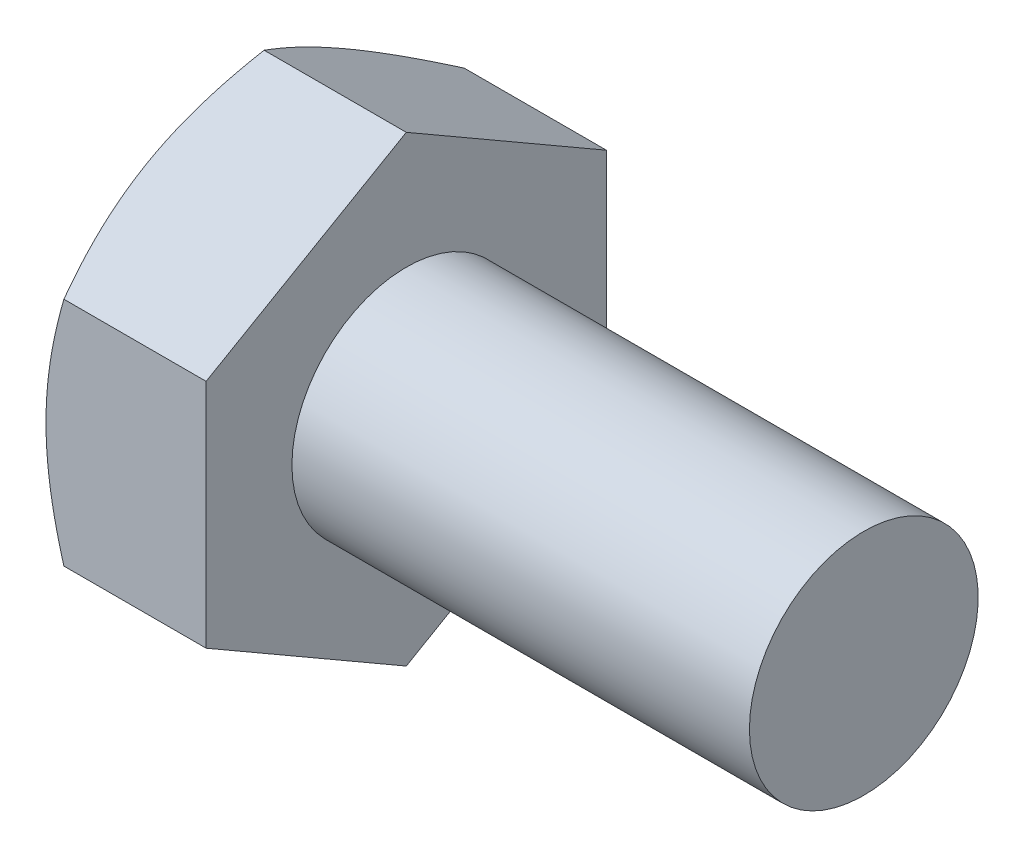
ISO-10303-21;
HEADER;
FILE_DESCRIPTION(('STEP AP214'),'2;1');
FILE_NAME('part.step','',(''),(''),'','','');
FILE_SCHEMA(('AUTOMOTIVE_DESIGN { 1 0 10303 214 1 1 1 1 }'));
ENDSEC;
DATA;
#1=APPLICATION_CONTEXT('core data for automotive mechanical design processes');
#2=APPLICATION_PROTOCOL_DEFINITION('international standard','automotive_design',2000,#1);
#3=PRODUCT_CONTEXT('',#1,'mechanical');
#4=PRODUCT('Part','Part','',(#3));
#5=PRODUCT_RELATED_PRODUCT_CATEGORY('part','',(#4));
#6=PRODUCT_DEFINITION_FORMATION('','',#4);
#7=PRODUCT_DEFINITION_CONTEXT('part definition',#1,'design');
#8=PRODUCT_DEFINITION('design','',#6,#7);
#9=PRODUCT_DEFINITION_SHAPE('','',#8);
#10=(LENGTH_UNIT() NAMED_UNIT(*) SI_UNIT(.MILLI.,.METRE.));
#11=(NAMED_UNIT(*) PLANE_ANGLE_UNIT() SI_UNIT($,.RADIAN.));
#12=(NAMED_UNIT(*) SI_UNIT($,.STERADIAN.) SOLID_ANGLE_UNIT());
#13=UNCERTAINTY_MEASURE_WITH_UNIT(LENGTH_MEASURE(1.E-05),#10,'distance_accuracy_value','');
#14=(GEOMETRIC_REPRESENTATION_CONTEXT(3) GLOBAL_UNCERTAINTY_ASSIGNED_CONTEXT((#13)) GLOBAL_UNIT_ASSIGNED_CONTEXT((#10,
#11,#12)) REPRESENTATION_CONTEXT('',''));
#15=CARTESIAN_POINT('',(0.,0.,0.));
#16=DIRECTION('',(0.,0.,1.));
#17=DIRECTION('',(1.,0.,0.));
#18=AXIS2_PLACEMENT_3D('',#15,#16,#17);
#19=CARTESIAN_POINT('',(-2.8,2.02072594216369,3.5));
#20=DIRECTION('',(0.,-0.866025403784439,-0.5));
#21=DIRECTION('',(0.,0.5,-0.866025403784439));
#22=AXIS2_PLACEMENT_3D('',#19,#20,#21);
#23=PLANE('',#22);
#24=CARTESIAN_POINT('',(-2.48693324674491,2.02061047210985,3.5002));
#25=CARTESIAN_POINT('',(-2.5382915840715,2.10942092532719,3.34637578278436));
#26=CARTESIAN_POINT('',(-2.58500077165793,2.19899991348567,3.19122042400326));
#27=CARTESIAN_POINT('',(-2.66653145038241,2.37971310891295,2.87821598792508));
#28=CARTESIAN_POINT('',(-2.70132400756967,2.47085054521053,2.72036131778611));
#29=CARTESIAN_POINT('',(-2.75547804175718,2.65199306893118,2.40661326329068));
#30=CARTESIAN_POINT('',(-2.77520098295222,2.7419701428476,2.25076839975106));
#31=CARTESIAN_POINT('',(-2.79873874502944,2.92234845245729,1.93834400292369));
#32=CARTESIAN_POINT('',(-2.80257313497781,3.01274902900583,1.78176561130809));
#33=CARTESIAN_POINT('',(-2.79456246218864,3.181643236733,1.48923226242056));
#34=CARTESIAN_POINT('',(-2.78468416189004,3.26016232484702,1.3532332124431));
#35=CARTESIAN_POINT('',(-2.7533870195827,3.41668759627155,1.08212348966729));
#36=CARTESIAN_POINT('',(-2.73195746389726,3.49469323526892,0.947013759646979));
#37=CARTESIAN_POINT('',(-2.67838950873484,3.65154177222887,0.675344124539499));
#38=CARTESIAN_POINT('',(-2.64602361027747,3.73036472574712,0.538818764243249));
#39=CARTESIAN_POINT('',(-2.57256969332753,3.88683231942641,0.267808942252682));
#40=CARTESIAN_POINT('',(-2.53149897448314,3.96447897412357,0.133320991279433));
#41=CARTESIAN_POINT('',(-2.48693324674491,4.04156735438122,-0.000199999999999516));
#42=B_SPLINE_CURVE_WITH_KNOTS('',3,(#24,#25,#26,#27,#28,#29,#30,#31,#32,#33,#34,#35,#36,#37,#38,
#39,#40,#41),.UNSPECIFIED.,.F.,.F.,(4,2,2,2,2,2,2,2,4),(0.,0.554909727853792,1.11115739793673,
1.65360313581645,2.19538057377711,2.66697654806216,3.13901067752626,3.62153963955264,
4.10311848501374),.UNSPECIFIED.);
#43=CARTESIAN_POINT('',(-2.487,2.02072594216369,3.5));
#44=VERTEX_POINT('',#43);
#45=CARTESIAN_POINT('',(-2.8,3.03108891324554,1.75));
#46=VERTEX_POINT('',#45);
#47=EDGE_CURVE('E118',#44,#46,#42,.T.);
#48=ORIENTED_EDGE('',*,*,#47,.F.);
#49=DIRECTION('',(1.,0.,0.));
#50=VECTOR('',#49,1.);
#51=CARTESIAN_POINT('',(-2.8,2.02072594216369,3.5));
#52=LINE('',#51,#50);
#53=CARTESIAN_POINT('',(0.,2.02072594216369,3.5));
#54=VERTEX_POINT('',#53);
#55=EDGE_CURVE('E64',#44,#54,#52,.T.);
#56=ORIENTED_EDGE('',*,*,#55,.T.);
#57=DIRECTION('',(0.,0.5,-0.866025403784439));
#58=VECTOR('',#57,1.);
#59=CARTESIAN_POINT('',(0.,2.02072594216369,3.5));
#60=LINE('',#59,#58);
#61=CARTESIAN_POINT('',(0.,4.04145188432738,0.));
#62=VERTEX_POINT('',#61);
#63=EDGE_CURVE('E128',#54,#62,#60,.T.);
#64=ORIENTED_EDGE('',*,*,#63,.T.);
#65=DIRECTION('',(1.,0.,0.));
#66=VECTOR('',#65,1.);
#67=CARTESIAN_POINT('',(-2.8,4.04145188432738,0.));
#68=LINE('',#67,#66);
#69=CARTESIAN_POINT('',(-2.487,4.04145188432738,0.));
#70=VERTEX_POINT('',#69);
#71=EDGE_CURVE('E147',#70,#62,#68,.T.);
#72=ORIENTED_EDGE('',*,*,#71,.F.);
#73=EDGE_CURVE('E127',#46,#70,#42,.T.);
#74=ORIENTED_EDGE('',*,*,#73,.F.);
#75=EDGE_LOOP('',(#48,#56,#64,#72,#74));
#76=FACE_BOUND('',#75,.T.);
#77=ADVANCED_FACE('F41',(#76),#23,.F.);
#78=CARTESIAN_POINT('',(-2.8,4.04145188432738,0.));
#79=DIRECTION('',(0.,-0.866025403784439,0.5));
#80=DIRECTION('',(0.,-0.5,-0.866025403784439));
#81=AXIS2_PLACEMENT_3D('',#78,#79,#80);
#82=PLANE('',#81);
#83=CARTESIAN_POINT('',(-2.48693324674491,4.04156735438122,0.000200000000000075));
#84=CARTESIAN_POINT('',(-2.5382915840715,3.95275690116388,-0.153624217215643));
#85=CARTESIAN_POINT('',(-2.58500077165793,3.8631779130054,-0.308779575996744));
#86=CARTESIAN_POINT('',(-2.66653145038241,3.68246471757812,-0.621784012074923));
#87=CARTESIAN_POINT('',(-2.70132400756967,3.59132728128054,-0.779638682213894));
#88=CARTESIAN_POINT('',(-2.75547804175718,3.41018475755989,-1.09338673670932));
#89=CARTESIAN_POINT('',(-2.77520098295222,3.32020768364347,-1.24923160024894));
#90=CARTESIAN_POINT('',(-2.79873874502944,3.13982937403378,-1.56165599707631));
#91=CARTESIAN_POINT('',(-2.80257313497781,3.04942879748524,-1.71823438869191));
#92=CARTESIAN_POINT('',(-2.79456246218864,2.88053458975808,-2.01076773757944));
#93=CARTESIAN_POINT('',(-2.78468416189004,2.80201550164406,-2.1467667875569));
#94=CARTESIAN_POINT('',(-2.7533870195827,2.64549023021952,-2.41787651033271));
#95=CARTESIAN_POINT('',(-2.73195746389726,2.56748459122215,-2.55298624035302));
#96=CARTESIAN_POINT('',(-2.67838950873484,2.4106360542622,-2.8246558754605));
#97=CARTESIAN_POINT('',(-2.64602361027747,2.33181310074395,-2.96118123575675));
#98=CARTESIAN_POINT('',(-2.57256969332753,2.17534550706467,-3.23219105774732));
#99=CARTESIAN_POINT('',(-2.53149897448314,2.0976988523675,-3.36667900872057));
#100=CARTESIAN_POINT('',(-2.48693324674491,2.02061047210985,-3.5002));
#101=B_SPLINE_CURVE_WITH_KNOTS('',3,(#83,#84,#85,#86,#87,#88,#89,#90,#91,#92,#93,#94,#95,#96,
#97,#98,#99,#100),.UNSPECIFIED.,.F.,.F.,(4,2,2,2,2,2,2,2,4),(0.,0.554909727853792,
1.11115739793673,1.65360313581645,2.19538057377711,2.66697654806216,3.13901067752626,
3.62153963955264,4.10311848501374),.UNSPECIFIED.);
#102=CARTESIAN_POINT('',(-2.8,3.03108891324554,-1.75));
#103=VERTEX_POINT('',#102);
#104=EDGE_CURVE('E221',#70,#103,#101,.T.);
#105=ORIENTED_EDGE('',*,*,#104,.F.);
#106=ORIENTED_EDGE('',*,*,#71,.T.);
#107=DIRECTION('',(0.,-0.5,-0.866025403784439));
#108=VECTOR('',#107,1.);
#109=CARTESIAN_POINT('',(0.,4.04145188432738,0.));
#110=LINE('',#109,#108);
#111=CARTESIAN_POINT('',(0.,2.02072594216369,-3.5));
#112=VERTEX_POINT('',#111);
#113=EDGE_CURVE('E223',#62,#112,#110,.T.);
#114=ORIENTED_EDGE('',*,*,#113,.T.);
#115=DIRECTION('',(1.,0.,0.));
#116=VECTOR('',#115,1.);
#117=CARTESIAN_POINT('',(-2.8,2.02072594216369,-3.5));
#118=LINE('',#117,#116);
#119=CARTESIAN_POINT('',(-2.487,2.02072594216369,-3.5));
#120=VERTEX_POINT('',#119);
#121=EDGE_CURVE('E145',#120,#112,#118,.T.);
#122=ORIENTED_EDGE('',*,*,#121,.F.);
#123=EDGE_CURVE('E180',#103,#120,#101,.T.);
#124=ORIENTED_EDGE('',*,*,#123,.F.);
#125=EDGE_LOOP('',(#105,#106,#114,#122,#124));
#126=FACE_BOUND('',#125,.T.);
#127=ADVANCED_FACE('F206',(#126),#82,.F.);
#128=CARTESIAN_POINT('',(-2.8,2.02072594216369,-3.5));
#129=DIRECTION('',(0.,0.,1.));
#130=DIRECTION('',(0.,-1.,0.));
#131=AXIS2_PLACEMENT_3D('',#128,#129,#130);
#132=PLANE('',#131);
#133=CARTESIAN_POINT('',(-1.12305521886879,-5.35925854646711,-3.5));
#134=CARTESIAN_POINT('',(-1.19740224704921,-5.2056051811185,-3.5));
#135=CARTESIAN_POINT('',(-1.27101064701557,-5.05158783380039,-3.5));
#136=CARTESIAN_POINT('',(-1.41632806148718,-4.74262833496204,-3.5));
#137=CARTESIAN_POINT('',(-1.48803674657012,-4.58768602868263,-3.5));
#138=CARTESIAN_POINT('',(-1.62951123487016,-4.27584086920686,-3.5));
#139=CARTESIAN_POINT('',(-1.69926353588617,-4.1189318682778,-3.5));
#140=CARTESIAN_POINT('',(-1.83577362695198,-3.80382160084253,-3.5));
#141=CARTESIAN_POINT('',(-1.90253157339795,-3.64562040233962,-3.5));
#142=CARTESIAN_POINT('',(-2.03305306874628,-3.32569968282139,-3.5));
#143=CARTESIAN_POINT('',(-2.09676950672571,-3.16396083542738,-3.5));
#144=CARTESIAN_POINT('',(-2.2192138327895,-2.83857116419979,-3.5));
#145=CARTESIAN_POINT('',(-2.27794116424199,-2.67492012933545,-3.5));
#146=CARTESIAN_POINT('',(-2.38882872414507,-2.3457817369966,-3.5));
#147=CARTESIAN_POINT('',(-2.44100294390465,-2.18029914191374,-3.5));
#148=CARTESIAN_POINT('',(-2.53708936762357,-1.84697567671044,-3.5));
#149=CARTESIAN_POINT('',(-2.58100419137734,-1.67913557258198,-3.5));
#150=CARTESIAN_POINT('',(-2.65843853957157,-1.34098184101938,-3.5));
#151=CARTESIAN_POINT('',(-2.69195529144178,-1.17066756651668,-3.5));
#152=CARTESIAN_POINT('',(-2.74633472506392,-0.827980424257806,-3.5));
#153=CARTESIAN_POINT('',(-2.76719740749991,-0.655607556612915,-3.5));
#154=CARTESIAN_POINT('',(-2.79442084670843,-0.310803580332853,-3.5));
#155=CARTESIAN_POINT('',(-2.80087376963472,-0.138379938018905,-3.5));
#156=CARTESIAN_POINT('',(-2.79893549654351,0.206345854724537,-3.5));
#157=CARTESIAN_POINT('',(-2.79054814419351,0.378648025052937,-3.5));
#158=CARTESIAN_POINT('',(-2.76416225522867,0.67267791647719,-3.5));
#159=CARTESIAN_POINT('',(-2.74961170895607,0.794732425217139,-3.5));
#160=CARTESIAN_POINT('',(-2.71400894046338,1.03789777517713,-3.5));
#161=CARTESIAN_POINT('',(-2.6929556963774,1.15900846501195,-3.5));
#162=CARTESIAN_POINT('',(-2.62114436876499,1.52082582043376,-3.5));
#163=CARTESIAN_POINT('',(-2.56175315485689,1.75983538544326,-3.5));
#164=CARTESIAN_POINT('',(-2.45932212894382,2.11747626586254,-3.5));
#165=CARTESIAN_POINT('',(-2.42243178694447,2.23797336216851,-3.5));
#166=CARTESIAN_POINT('',(-2.3450007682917,2.47770858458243,-3.5));
#167=CARTESIAN_POINT('',(-2.30446260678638,2.59694751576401,-3.5));
#168=CARTESIAN_POINT('',(-2.22057855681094,2.83366836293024,-3.5));
#169=CARTESIAN_POINT('',(-2.17724973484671,2.95115638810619,-3.5));
#170=CARTESIAN_POINT('',(-2.08804798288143,3.18521921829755,-3.5));
#171=CARTESIAN_POINT('',(-2.04217402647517,3.30179363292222,-3.5));
#172=CARTESIAN_POINT('',(-1.99527837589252,3.41794571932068,-3.5));
#173=B_SPLINE_CURVE_WITH_KNOTS('',3,(#133,#134,#135,#136,#137,#138,#139,#140,#141,#142,#143,
#144,#145,#146,#147,#148,#149,#150,#151,#152,#153,#154,#155,#156,#157,#158,#159,#160,#161,#162,
#163,#164,#165,#166,#167,#168,#169,#170,#171,#172),.UNSPECIFIED.,.F.,.F.,(4,2,2,2,2,2,2,2,2,2,2,
2,2,2,2,2,2,2,2,4),(0.,0.512092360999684,1.02427294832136,1.53939112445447,2.05448236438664,
2.57592921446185,3.09743416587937,3.61780602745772,4.1380125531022,4.65835766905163,
5.17870275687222,5.69571001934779,6.21258339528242,6.58115988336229,6.94979432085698,
7.68761068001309,8.06563354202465,8.44339772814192,8.81903810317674,9.1948310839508),.UNSPECIFIED.);
#174=CARTESIAN_POINT('',(-2.8,0.,-3.5));
#175=VERTEX_POINT('',#174);
#176=EDGE_CURVE('E173',#120,#175,#173,.F.);
#177=ORIENTED_EDGE('',*,*,#176,.F.);
#178=ORIENTED_EDGE('',*,*,#121,.T.);
#179=DIRECTION('',(0.,-1.,0.));
#180=VECTOR('',#179,1.);
#181=CARTESIAN_POINT('',(0.,2.02072594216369,-3.5));
#182=LINE('',#181,#180);
#183=CARTESIAN_POINT('',(0.,-2.02072594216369,-3.5));
#184=VERTEX_POINT('',#183);
#185=EDGE_CURVE('E226',#112,#184,#182,.T.);
#186=ORIENTED_EDGE('',*,*,#185,.T.);
#187=DIRECTION('',(1.,0.,0.));
#188=VECTOR('',#187,1.);
#189=CARTESIAN_POINT('',(-2.8,-2.02072594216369,-3.5));
#190=LINE('',#189,#188);
#191=CARTESIAN_POINT('',(-2.487,-2.02072594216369,-3.5));
#192=VERTEX_POINT('',#191);
#193=EDGE_CURVE('E143',#192,#184,#190,.T.);
#194=ORIENTED_EDGE('',*,*,#193,.F.);
#195=EDGE_CURVE('E171',#175,#192,#173,.F.);
#196=ORIENTED_EDGE('',*,*,#195,.F.);
#197=EDGE_LOOP('',(#177,#178,#186,#194,#196));
#198=FACE_BOUND('',#197,.T.);
#199=ADVANCED_FACE('F172',(#198),#132,.F.);
#200=CARTESIAN_POINT('',(-2.8,-2.02072594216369,-3.5));
#201=DIRECTION('',(0.,0.866025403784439,0.5));
#202=DIRECTION('',(0.,-0.5,0.866025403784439));
#203=AXIS2_PLACEMENT_3D('',#200,#201,#202);
#204=PLANE('',#203);
#205=CARTESIAN_POINT('',(-2.48693324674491,-2.02061047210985,-3.5002));
#206=CARTESIAN_POINT('',(-2.5382915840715,-2.10942092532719,-3.34637578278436));
#207=CARTESIAN_POINT('',(-2.58500077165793,-2.19899991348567,-3.19122042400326));
#208=CARTESIAN_POINT('',(-2.66653145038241,-2.37971310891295,-2.87821598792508));
#209=CARTESIAN_POINT('',(-2.70132400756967,-2.47085054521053,-2.72036131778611));
#210=CARTESIAN_POINT('',(-2.75547804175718,-2.65199306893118,-2.40661326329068));
#211=CARTESIAN_POINT('',(-2.77520098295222,-2.7419701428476,-2.25076839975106));
#212=CARTESIAN_POINT('',(-2.79873874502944,-2.92234845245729,-1.93834400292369));
#213=CARTESIAN_POINT('',(-2.80257313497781,-3.01274902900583,-1.78176561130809));
#214=CARTESIAN_POINT('',(-2.79456246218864,-3.181643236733,-1.48923226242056));
#215=CARTESIAN_POINT('',(-2.78468416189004,-3.26016232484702,-1.3532332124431));
#216=CARTESIAN_POINT('',(-2.7533870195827,-3.41668759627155,-1.08212348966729));
#217=CARTESIAN_POINT('',(-2.73195746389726,-3.49469323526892,-0.947013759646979));
#218=CARTESIAN_POINT('',(-2.67838950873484,-3.65154177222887,-0.6753441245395));
#219=CARTESIAN_POINT('',(-2.64602361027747,-3.73036472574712,-0.538818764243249));
#220=CARTESIAN_POINT('',(-2.57256969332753,-3.88683231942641,-0.267808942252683));
#221=CARTESIAN_POINT('',(-2.53149897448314,-3.96447897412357,-0.133320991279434));
#222=CARTESIAN_POINT('',(-2.48693324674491,-4.04156735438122,0.000199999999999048));
#223=B_SPLINE_CURVE_WITH_KNOTS('',3,(#205,#206,#207,#208,#209,#210,#211,#212,#213,#214,#215,
#216,#217,#218,#219,#220,#221,#222),.UNSPECIFIED.,.F.,.F.,(4,2,2,2,2,2,2,2,4),(0.,
0.554909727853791,1.11115739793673,1.65360313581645,2.19538057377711,2.66697654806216,
3.13901067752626,3.62153963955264,4.10311848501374),.UNSPECIFIED.);
#224=CARTESIAN_POINT('',(-2.8,-3.03108891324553,-1.75));
#225=VERTEX_POINT('',#224);
#226=EDGE_CURVE('E178',#192,#225,#223,.T.);
#227=ORIENTED_EDGE('',*,*,#226,.F.);
#228=ORIENTED_EDGE('',*,*,#193,.T.);
#229=DIRECTION('',(0.,-0.5,0.866025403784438));
#230=VECTOR('',#229,1.);
#231=CARTESIAN_POINT('',(0.,-2.02072594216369,-3.5));
#232=LINE('',#231,#230);
#233=CARTESIAN_POINT('',(0.,-4.04145188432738,0.));
#234=VERTEX_POINT('',#233);
#235=EDGE_CURVE('E228',#184,#234,#232,.T.);
#236=ORIENTED_EDGE('',*,*,#235,.T.);
#237=DIRECTION('',(1.,0.,0.));
#238=VECTOR('',#237,1.);
#239=CARTESIAN_POINT('',(-2.8,-4.04145188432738,0.));
#240=LINE('',#239,#238);
#241=CARTESIAN_POINT('',(-2.487,-4.04145188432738,0.));
#242=VERTEX_POINT('',#241);
#243=EDGE_CURVE('E136',#242,#234,#240,.T.);
#244=ORIENTED_EDGE('',*,*,#243,.F.);
#245=EDGE_CURVE('E181',#225,#242,#223,.T.);
#246=ORIENTED_EDGE('',*,*,#245,.F.);
#247=EDGE_LOOP('',(#227,#228,#236,#244,#246));
#248=FACE_BOUND('',#247,.T.);
#249=ADVANCED_FACE('F205',(#248),#204,.F.);
#250=CARTESIAN_POINT('',(-2.8,-4.04145188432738,0.));
#251=DIRECTION('',(0.,0.866025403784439,-0.5));
#252=DIRECTION('',(0.,0.5,0.866025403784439));
#253=AXIS2_PLACEMENT_3D('',#250,#251,#252);
#254=PLANE('',#253);
#255=CARTESIAN_POINT('',(-2.48693324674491,-4.04156735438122,-0.000200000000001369));
#256=CARTESIAN_POINT('',(-2.5382915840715,-3.95275690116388,0.153624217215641));
#257=CARTESIAN_POINT('',(-2.58500077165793,-3.8631779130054,0.308779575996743));
#258=CARTESIAN_POINT('',(-2.66653145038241,-3.68246471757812,0.621784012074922));
#259=CARTESIAN_POINT('',(-2.70132400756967,-3.59132728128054,0.779638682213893));
#260=CARTESIAN_POINT('',(-2.75547804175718,-3.41018475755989,1.09338673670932));
#261=CARTESIAN_POINT('',(-2.77520098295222,-3.32020768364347,1.24923160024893));
#262=CARTESIAN_POINT('',(-2.79873874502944,-3.13982937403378,1.56165599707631));
#263=CARTESIAN_POINT('',(-2.80257313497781,-3.04942879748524,1.7182343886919));
#264=CARTESIAN_POINT('',(-2.79456246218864,-2.88053458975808,2.01076773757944));
#265=CARTESIAN_POINT('',(-2.78468416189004,-2.80201550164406,2.1467667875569));
#266=CARTESIAN_POINT('',(-2.7533870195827,-2.64549023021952,2.41787651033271));
#267=CARTESIAN_POINT('',(-2.73195746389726,-2.56748459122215,2.55298624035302));
#268=CARTESIAN_POINT('',(-2.67838950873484,-2.4106360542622,2.8246558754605));
#269=CARTESIAN_POINT('',(-2.64602361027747,-2.33181310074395,2.96118123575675));
#270=CARTESIAN_POINT('',(-2.57256969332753,-2.17534550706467,3.23219105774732));
#271=CARTESIAN_POINT('',(-2.53149897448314,-2.0976988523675,3.36667900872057));
#272=CARTESIAN_POINT('',(-2.48693324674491,-2.02061047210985,3.5002));
#273=B_SPLINE_CURVE_WITH_KNOTS('',3,(#255,#256,#257,#258,#259,#260,#261,#262,#263,#264,#265,
#266,#267,#268,#269,#270,#271,#272),.UNSPECIFIED.,.F.,.F.,(4,2,2,2,2,2,2,2,4),(0.,
0.554909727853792,1.11115739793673,1.65360313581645,2.19538057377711,2.66697654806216,
3.13901067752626,3.62153963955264,4.10311848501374),.UNSPECIFIED.);
#274=CARTESIAN_POINT('',(-2.8,-3.03108891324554,1.75));
#275=VERTEX_POINT('',#274);
#276=EDGE_CURVE('E250',#242,#275,#273,.T.);
#277=ORIENTED_EDGE('',*,*,#276,.F.);
#278=ORIENTED_EDGE('',*,*,#243,.T.);
#279=DIRECTION('',(0.,0.5,0.866025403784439));
#280=VECTOR('',#279,1.);
#281=CARTESIAN_POINT('',(0.,-4.04145188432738,0.));
#282=LINE('',#281,#280);
#283=CARTESIAN_POINT('',(0.,-2.02072594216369,3.5));
#284=VERTEX_POINT('',#283);
#285=EDGE_CURVE('E138',#234,#284,#282,.T.);
#286=ORIENTED_EDGE('',*,*,#285,.T.);
#287=DIRECTION('',(1.,0.,0.));
#288=VECTOR('',#287,1.);
#289=CARTESIAN_POINT('',(-2.8,-2.02072594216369,3.5));
#290=LINE('',#289,#288);
#291=CARTESIAN_POINT('',(-2.487,-2.02072594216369,3.5));
#292=VERTEX_POINT('',#291);
#293=EDGE_CURVE('E134',#292,#284,#290,.T.);
#294=ORIENTED_EDGE('',*,*,#293,.F.);
#295=EDGE_CURVE('E251',#275,#292,#273,.T.);
#296=ORIENTED_EDGE('',*,*,#295,.F.);
#297=EDGE_LOOP('',(#277,#278,#286,#294,#296));
#298=FACE_BOUND('',#297,.T.);
#299=ADVANCED_FACE('F235',(#298),#254,.F.);
#300=CARTESIAN_POINT('',(-2.8,-2.02072594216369,3.5));
#301=DIRECTION('',(0.,0.,-1.));
#302=DIRECTION('',(0.,1.,0.));
#303=AXIS2_PLACEMENT_3D('',#300,#301,#302);
#304=PLANE('',#303);
#305=CARTESIAN_POINT('',(-1.12305461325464,-5.35925979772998,3.5));
#306=CARTESIAN_POINT('',(-1.19740166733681,-5.2056063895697,3.5));
#307=CARTESIAN_POINT('',(-1.27101009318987,-5.05158899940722,3.5));
#308=CARTESIAN_POINT('',(-1.41632755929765,-4.74262941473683,3.5));
#309=CARTESIAN_POINT('',(-1.48803627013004,-4.58768706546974,3.5));
#310=CARTESIAN_POINT('',(-1.62951080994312,-4.27584181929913,3.5));
#311=CARTESIAN_POINT('',(-1.69926313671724,-4.11893277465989,3.5));
#312=CARTESIAN_POINT('',(-1.83577327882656,-3.80382241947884,3.5));
#313=CARTESIAN_POINT('',(-1.90253125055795,-3.64562117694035,3.5));
#314=CARTESIAN_POINT('',(-2.03305279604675,-3.32570036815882,3.5));
#315=CARTESIAN_POINT('',(-2.09676925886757,-3.16396147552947,3.5));
#316=CARTESIAN_POINT('',(-2.21921363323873,-2.83857171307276,3.5));
#317=CARTESIAN_POINT('',(-2.27794098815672,-2.67492063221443,3.5));
#318=CARTESIAN_POINT('',(-2.38882859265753,-2.34578214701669,3.5));
#319=CARTESIAN_POINT('',(-2.44100283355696,-2.18029950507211,3.5));
#320=CARTESIAN_POINT('',(-2.53708929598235,-1.84697594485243,3.5));
#321=CARTESIAN_POINT('',(-2.58100413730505,-1.67913579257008,3.5));
#322=CARTESIAN_POINT('',(-2.6584385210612,-1.34098193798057,3.5));
#323=CARTESIAN_POINT('',(-2.69195528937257,-1.1706675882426,3.5));
#324=CARTESIAN_POINT('',(-2.74633474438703,-0.827980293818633,3.5));
#325=CARTESIAN_POINT('',(-2.76719743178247,-0.655607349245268,3.5));
#326=CARTESIAN_POINT('',(-2.79442086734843,-0.310803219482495,3.5));
#327=CARTESIAN_POINT('',(-2.8008737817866,-0.138379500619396,3.5));
#328=CARTESIAN_POINT('',(-2.79893547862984,0.206346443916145,3.5));
#329=CARTESIAN_POINT('',(-2.79054810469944,0.378648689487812,3.5));
#330=CARTESIAN_POINT('',(-2.76416217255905,0.672678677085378,3.5));
#331=CARTESIAN_POINT('',(-2.74961160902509,0.794733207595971,3.5));
#332=CARTESIAN_POINT('',(-2.71400880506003,1.03789860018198,3.5));
#333=CARTESIAN_POINT('',(-2.69295554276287,1.15900931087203,3.5));
#334=CARTESIAN_POINT('',(-2.62114416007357,1.52082672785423,3.5));
#335=CARTESIAN_POINT('',(-2.56175290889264,1.75983633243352,3.5));
#336=CARTESIAN_POINT('',(-2.45932182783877,2.11747727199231,3.5));
#337=CARTESIAN_POINT('',(-2.42243146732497,2.2379743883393,3.5));
#338=CARTESIAN_POINT('',(-2.34500041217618,2.47770965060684,3.5));
#339=CARTESIAN_POINT('',(-2.30446223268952,2.59694860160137,3.5));
#340=CARTESIAN_POINT('',(-2.22057814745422,2.83366948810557,3.5));
#341=CARTESIAN_POINT('',(-2.17724930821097,2.95115753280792,3.5));
#342=CARTESIAN_POINT('',(-2.08804752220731,3.18522040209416,3.5));
#343=CARTESIAN_POINT('',(-2.04217354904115,3.30179483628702,3.5));
#344=CARTESIAN_POINT('',(-1.9952778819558,3.41794694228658,3.5));
#345=B_SPLINE_CURVE_WITH_KNOTS('',3,(#305,#306,#307,#308,#309,#310,#311,#312,#313,#314,#315,
#316,#317,#318,#319,#320,#321,#322,#323,#324,#325,#326,#327,#328,#329,#330,#331,#332,#333,#334,
#335,#336,#337,#338,#339,#340,#341,#342,#343,#344),.UNSPECIFIED.,.F.,.F.,(4,2,2,2,2,2,2,2,2,2,2,
2,2,2,2,2,2,2,2,4),(0.,0.512092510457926,1.02427324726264,1.5393915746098,2.0544829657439,
2.57592996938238,3.09743507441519,3.61780708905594,4.13801376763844,4.65835911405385,
5.17870443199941,5.69571192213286,6.2125855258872,6.58116208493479,6.94979659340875,
7.68761309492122,8.06563603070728,8.44340029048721,8.81904073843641,9.19483379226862),.UNSPECIFIED.);
#346=CARTESIAN_POINT('',(-2.8,0.,3.5));
#347=VERTEX_POINT('',#346);
#348=EDGE_CURVE('E123',#292,#347,#345,.T.);
#349=ORIENTED_EDGE('',*,*,#348,.F.);
#350=ORIENTED_EDGE('',*,*,#293,.T.);
#351=DIRECTION('',(0.,1.,0.));
#352=VECTOR('',#351,1.);
#353=CARTESIAN_POINT('',(0.,-2.02072594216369,3.5));
#354=LINE('',#353,#352);
#355=EDGE_CURVE('E132',#284,#54,#354,.T.);
#356=ORIENTED_EDGE('',*,*,#355,.T.);
#357=ORIENTED_EDGE('',*,*,#55,.F.);
#358=EDGE_CURVE('E116',#347,#44,#345,.T.);
#359=ORIENTED_EDGE('',*,*,#358,.F.);
#360=EDGE_LOOP('',(#349,#350,#356,#357,#359));
#361=FACE_BOUND('',#360,.T.);
#362=ADVANCED_FACE('F130',(#361),#304,.F.);
#363=CARTESIAN_POINT('',(8.,2.,0.));
#364=DIRECTION('',(-1.,0.,0.));
#365=DIRECTION('',(0.,0.,1.));
#366=AXIS2_PLACEMENT_3D('',#363,#364,#365);
#367=PLANE('',#366);
#368=CARTESIAN_POINT('',(8.,0.,0.));
#369=DIRECTION('',(-1.,0.,0.));
#370=DIRECTION('',(0.,0.,1.));
#371=AXIS2_PLACEMENT_3D('',#368,#369,#370);
#372=CIRCLE('',#371,2.);
#373=CARTESIAN_POINT('',(8.,0.,2.));
#374=VERTEX_POINT('',#373);
#375=EDGE_CURVE('E151',#374,#374,#372,.T.);
#376=ORIENTED_EDGE('',*,*,#375,.F.);
#377=EDGE_LOOP('',(#376));
#378=FACE_BOUND('',#377,.T.);
#379=ADVANCED_FACE('F43',(#378),#367,.F.);
#380=CARTESIAN_POINT('',(0.,0.,0.));
#381=DIRECTION('',(-1.,0.,0.));
#382=DIRECTION('',(0.,0.,1.));
#383=AXIS2_PLACEMENT_3D('',#380,#381,#382);
#384=CYLINDRICAL_SURFACE('',#383,2.);
#385=CARTESIAN_POINT('',(0.,0.,0.));
#386=DIRECTION('',(-1.,0.,0.));
#387=DIRECTION('',(0.,0.,1.));
#388=AXIS2_PLACEMENT_3D('',#385,#386,#387);
#389=CIRCLE('',#388,2.);
#390=CARTESIAN_POINT('',(0.,0.,2.));
#391=VERTEX_POINT('',#390);
#392=EDGE_CURVE('E149',#391,#391,#389,.T.);
#393=ORIENTED_EDGE('',*,*,#392,.F.);
#394=EDGE_LOOP('',(#393));
#395=FACE_BOUND('',#394,.T.);
#396=ORIENTED_EDGE('',*,*,#375,.T.);
#397=EDGE_LOOP('',(#396));
#398=FACE_BOUND('',#397,.T.);
#399=ADVANCED_FACE('F215',(#395,#398),#384,.T.);
#400=CARTESIAN_POINT('',(0.,0.,0.));
#401=DIRECTION('',(-1.,0.,0.));
#402=DIRECTION('',(0.,0.,1.));
#403=AXIS2_PLACEMENT_3D('',#400,#401,#402);
#404=PLANE('',#403);
#405=ORIENTED_EDGE('',*,*,#63,.F.);
#406=ORIENTED_EDGE('',*,*,#355,.F.);
#407=ORIENTED_EDGE('',*,*,#285,.F.);
#408=ORIENTED_EDGE('',*,*,#235,.F.);
#409=ORIENTED_EDGE('',*,*,#185,.F.);
#410=ORIENTED_EDGE('',*,*,#113,.F.);
#411=EDGE_LOOP('',(#405,#406,#407,#408,#409,#410));
#412=FACE_BOUND('',#411,.T.);
#413=ORIENTED_EDGE('',*,*,#392,.T.);
#414=EDGE_LOOP('',(#413));
#415=FACE_BOUND('',#414,.T.);
#416=ADVANCED_FACE('F239',(#412,#415),#404,.F.);
#417=CARTESIAN_POINT('',(-2.8,0.,0.));
#418=DIRECTION('',(1.,0.,0.));
#419=DIRECTION('',(0.,0.,-1.));
#420=AXIS2_PLACEMENT_3D('',#417,#418,#419);
#421=CONICAL_SURFACE('',#420,3.5,1.04665389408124);
#422=ORIENTED_EDGE('',*,*,#295,.T.);
#423=ORIENTED_EDGE('',*,*,#348,.T.);
#424=CARTESIAN_POINT('',(-2.8,0.,0.));
#425=DIRECTION('',(-1.,0.,0.));
#426=DIRECTION('',(0.,0.,1.));
#427=AXIS2_PLACEMENT_3D('',#424,#425,#426);
#428=CIRCLE('',#427,3.5);
#429=EDGE_CURVE('E45',#275,#347,#428,.T.);
#430=ORIENTED_EDGE('',*,*,#429,.F.);
#431=EDGE_LOOP('',(#422,#423,#430));
#432=FACE_BOUND('',#431,.T.);
#433=ADVANCED_FACE('F253',(#432),#421,.T.);
#434=ORIENTED_EDGE('',*,*,#245,.T.);
#435=ORIENTED_EDGE('',*,*,#276,.T.);
#436=EDGE_CURVE('E155',#225,#275,#428,.T.);
#437=ORIENTED_EDGE('',*,*,#436,.F.);
#438=EDGE_LOOP('',(#434,#435,#437));
#439=FACE_BOUND('',#438,.T.);
#440=ADVANCED_FACE('F249',(#439),#421,.T.);
#441=ORIENTED_EDGE('',*,*,#195,.T.);
#442=ORIENTED_EDGE('',*,*,#226,.T.);
#443=EDGE_CURVE('E156',#175,#225,#428,.T.);
#444=ORIENTED_EDGE('',*,*,#443,.F.);
#445=EDGE_LOOP('',(#441,#442,#444));
#446=FACE_BOUND('',#445,.T.);
#447=ADVANCED_FACE('F246',(#446),#421,.T.);
#448=ORIENTED_EDGE('',*,*,#123,.T.);
#449=ORIENTED_EDGE('',*,*,#176,.T.);
#450=EDGE_CURVE('E50',#103,#175,#428,.T.);
#451=ORIENTED_EDGE('',*,*,#450,.F.);
#452=EDGE_LOOP('',(#448,#449,#451));
#453=FACE_BOUND('',#452,.T.);
#454=ADVANCED_FACE('F245',(#453),#421,.T.);
#455=ORIENTED_EDGE('',*,*,#73,.T.);
#456=ORIENTED_EDGE('',*,*,#104,.T.);
#457=EDGE_CURVE('E11',#46,#103,#428,.T.);
#458=ORIENTED_EDGE('',*,*,#457,.F.);
#459=EDGE_LOOP('',(#455,#456,#458));
#460=FACE_BOUND('',#459,.T.);
#461=ADVANCED_FACE('F357',(#460),#421,.T.);
#462=ORIENTED_EDGE('',*,*,#47,.T.);
#463=CARTESIAN_POINT('',(-2.8,0.,0.));
#464=DIRECTION('',(-1.,0.,0.));
#465=DIRECTION('',(0.,0.,1.));
#466=AXIS2_PLACEMENT_3D('',#463,#464,#465);
#467=CIRCLE('',#466,3.5);
#468=EDGE_CURVE('E120',#347,#46,#467,.T.);
#469=ORIENTED_EDGE('',*,*,#468,.F.);
#470=ORIENTED_EDGE('',*,*,#358,.T.);
#471=EDGE_LOOP('',(#462,#469,#470));
#472=FACE_BOUND('',#471,.T.);
#473=ADVANCED_FACE('F117',(#472),#421,.T.);
#474=CARTESIAN_POINT('',(-2.8,0.,0.));
#475=DIRECTION('',(-1.,0.,0.));
#476=DIRECTION('',(0.,0.,1.));
#477=AXIS2_PLACEMENT_3D('',#474,#475,#476);
#478=PLANE('',#477);
#479=ORIENTED_EDGE('',*,*,#429,.T.);
#480=ORIENTED_EDGE('',*,*,#468,.T.);
#481=ORIENTED_EDGE('',*,*,#457,.T.);
#482=ORIENTED_EDGE('',*,*,#450,.T.);
#483=ORIENTED_EDGE('',*,*,#443,.T.);
#484=ORIENTED_EDGE('',*,*,#436,.T.);
#485=EDGE_LOOP('',(#479,#480,#481,#482,#483,#484));
#486=FACE_BOUND('',#485,.T.);
#487=ADVANCED_FACE('F165',(#486),#478,.T.);
#488=CLOSED_SHELL('',(#77,#127,#199,#249,#299,#362,#379,#399,#416,#433,#440,#447,#454,#461,#473,#487));
#489=MANIFOLD_SOLID_BREP('B2',#488);
#490=ADVANCED_BREP_SHAPE_REPRESENTATION('',(#18,#489),#14);
#491=SHAPE_DEFINITION_REPRESENTATION(#9,#490);
ENDSEC;
END-ISO-10303-21;
